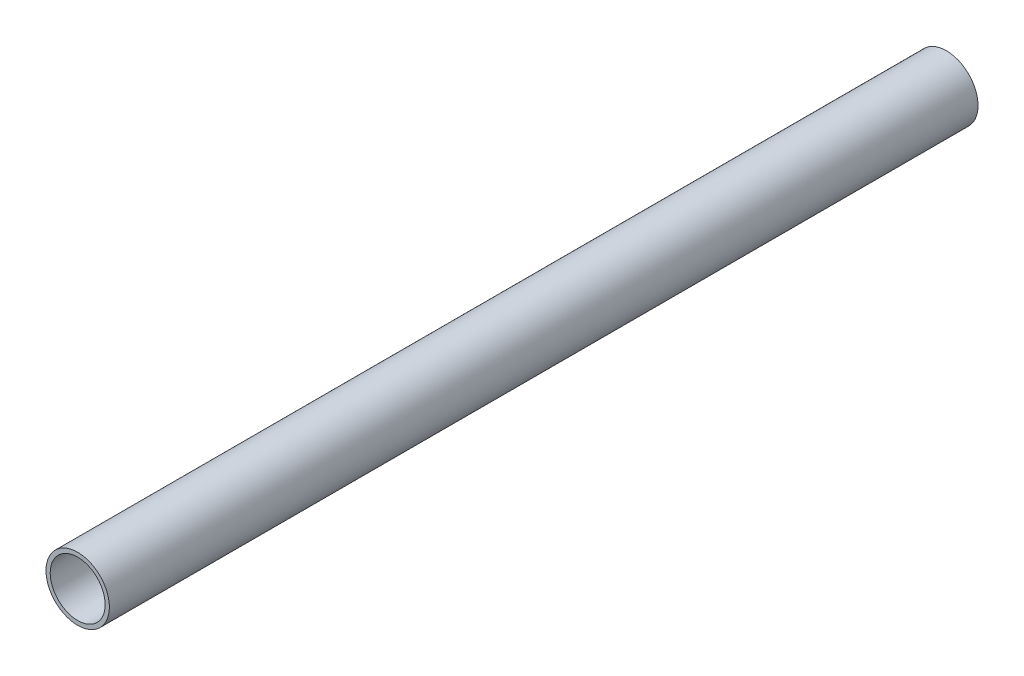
ISO-10303-21;
HEADER;
FILE_DESCRIPTION(('STEP AP214'),'2;1');
FILE_NAME('part.step','',(''),(''),'','','');
FILE_SCHEMA(('AUTOMOTIVE_DESIGN { 1 0 10303 214 1 1 1 1 }'));
ENDSEC;
DATA;
#1=APPLICATION_CONTEXT('core data for automotive mechanical design processes');
#2=APPLICATION_PROTOCOL_DEFINITION('international standard','automotive_design',2000,#1);
#3=PRODUCT_CONTEXT('',#1,'mechanical');
#4=PRODUCT('Part','Part','',(#3));
#5=PRODUCT_RELATED_PRODUCT_CATEGORY('part','',(#4));
#6=PRODUCT_DEFINITION_FORMATION('','',#4);
#7=PRODUCT_DEFINITION_CONTEXT('part definition',#1,'design');
#8=PRODUCT_DEFINITION('design','',#6,#7);
#9=PRODUCT_DEFINITION_SHAPE('','',#8);
#10=(LENGTH_UNIT() NAMED_UNIT(*) SI_UNIT(.MILLI.,.METRE.));
#11=(NAMED_UNIT(*) PLANE_ANGLE_UNIT() SI_UNIT($,.RADIAN.));
#12=(NAMED_UNIT(*) SI_UNIT($,.STERADIAN.) SOLID_ANGLE_UNIT());
#13=UNCERTAINTY_MEASURE_WITH_UNIT(LENGTH_MEASURE(1.E-05),#10,'distance_accuracy_value','');
#14=(GEOMETRIC_REPRESENTATION_CONTEXT(3) GLOBAL_UNCERTAINTY_ASSIGNED_CONTEXT((#13)) GLOBAL_UNIT_ASSIGNED_CONTEXT((#10,
#11,#12)) REPRESENTATION_CONTEXT('',''));
#15=CARTESIAN_POINT('',(0.,0.,0.));
#16=DIRECTION('',(0.,0.,1.));
#17=DIRECTION('',(1.,0.,0.));
#18=AXIS2_PLACEMENT_3D('',#15,#16,#17);
#19=CARTESIAN_POINT('',(0.,0.,304.8));
#20=DIRECTION('',(0.,0.,1.));
#21=DIRECTION('',(1.,0.,0.));
#22=AXIS2_PLACEMENT_3D('',#19,#20,#21);
#23=PLANE('',#22);
#24=CARTESIAN_POINT('',(0.,0.,304.8));
#25=DIRECTION('',(0.,0.,1.));
#26=DIRECTION('',(1.,0.,0.));
#27=AXIS2_PLACEMENT_3D('',#24,#25,#26);
#28=CIRCLE('',#27,11.1125);
#29=CARTESIAN_POINT('',(-11.1125,0.,304.8));
#30=VERTEX_POINT('',#29);
#31=EDGE_CURVE('E11',#30,#30,#28,.T.);
#32=ORIENTED_EDGE('',*,*,#31,.T.);
#33=EDGE_LOOP('',(#32));
#34=FACE_BOUND('',#33,.T.);
#35=CARTESIAN_POINT('',(0.,0.,304.8));
#36=DIRECTION('',(0.,0.,1.));
#37=DIRECTION('',(1.,0.,0.));
#38=AXIS2_PLACEMENT_3D('',#35,#36,#37);
#39=CIRCLE('',#38,9.6393);
#40=CARTESIAN_POINT('',(-9.6393,0.,304.8));
#41=VERTEX_POINT('',#40);
#42=EDGE_CURVE('E48',#41,#41,#39,.T.);
#43=ORIENTED_EDGE('',*,*,#42,.F.);
#44=EDGE_LOOP('',(#43));
#45=FACE_BOUND('',#44,.T.);
#46=ADVANCED_FACE('F37',(#34,#45),#23,.T.);
#47=CARTESIAN_POINT('',(0.,0.,0.));
#48=DIRECTION('',(0.,0.,1.));
#49=DIRECTION('',(1.,0.,0.));
#50=AXIS2_PLACEMENT_3D('',#47,#48,#49);
#51=PLANE('',#50);
#52=CARTESIAN_POINT('',(0.,0.,0.));
#53=DIRECTION('',(0.,0.,1.));
#54=DIRECTION('',(1.,0.,0.));
#55=AXIS2_PLACEMENT_3D('',#52,#53,#54);
#56=CIRCLE('',#55,11.1125);
#57=CARTESIAN_POINT('',(-11.1125,0.,0.));
#58=VERTEX_POINT('',#57);
#59=EDGE_CURVE('E41',#58,#58,#56,.T.);
#60=ORIENTED_EDGE('',*,*,#59,.F.);
#61=EDGE_LOOP('',(#60));
#62=FACE_BOUND('',#61,.T.);
#63=CARTESIAN_POINT('',(0.,0.,0.));
#64=DIRECTION('',(0.,0.,1.));
#65=DIRECTION('',(1.,0.,0.));
#66=AXIS2_PLACEMENT_3D('',#63,#64,#65);
#67=CIRCLE('',#66,9.6393);
#68=CARTESIAN_POINT('',(-9.6393,0.,0.));
#69=VERTEX_POINT('',#68);
#70=EDGE_CURVE('E50',#69,#69,#67,.T.);
#71=ORIENTED_EDGE('',*,*,#70,.T.);
#72=EDGE_LOOP('',(#71));
#73=FACE_BOUND('',#72,.T.);
#74=ADVANCED_FACE('F60',(#62,#73),#51,.F.);
#75=CARTESIAN_POINT('',(0.,0.,304.8));
#76=DIRECTION('',(0.,0.,-1.));
#77=DIRECTION('',(-1.,0.,0.));
#78=AXIS2_PLACEMENT_3D('',#75,#76,#77);
#79=CYLINDRICAL_SURFACE('',#78,11.1125);
#80=CARTESIAN_POINT('',(-11.1125,0.,304.8));
#81=CARTESIAN_POINT('',(-11.1125,0.,301.625));
#82=CARTESIAN_POINT('',(-11.1125,0.,298.45));
#83=CARTESIAN_POINT('',(-11.1125,0.,292.1));
#84=CARTESIAN_POINT('',(-11.1125,0.,288.925));
#85=CARTESIAN_POINT('',(-11.1125,0.,282.575));
#86=CARTESIAN_POINT('',(-11.1125,0.,279.4));
#87=CARTESIAN_POINT('',(-11.1125,0.,273.05));
#88=CARTESIAN_POINT('',(-11.1125,0.,269.875));
#89=CARTESIAN_POINT('',(-11.1125,0.,263.525));
#90=CARTESIAN_POINT('',(-11.1125,0.,260.35));
#91=CARTESIAN_POINT('',(-11.1125,0.,254.));
#92=CARTESIAN_POINT('',(-11.1125,0.,250.825));
#93=CARTESIAN_POINT('',(-11.1125,0.,244.475));
#94=CARTESIAN_POINT('',(-11.1125,0.,241.3));
#95=CARTESIAN_POINT('',(-11.1125,0.,234.95));
#96=CARTESIAN_POINT('',(-11.1125,0.,231.775));
#97=CARTESIAN_POINT('',(-11.1125,0.,225.425));
#98=CARTESIAN_POINT('',(-11.1125,0.,222.25));
#99=CARTESIAN_POINT('',(-11.1125,0.,215.9));
#100=CARTESIAN_POINT('',(-11.1125,0.,212.725));
#101=CARTESIAN_POINT('',(-11.1125,0.,206.375));
#102=CARTESIAN_POINT('',(-11.1125,0.,203.2));
#103=CARTESIAN_POINT('',(-11.1125,0.,196.85));
#104=CARTESIAN_POINT('',(-11.1125,0.,193.675));
#105=CARTESIAN_POINT('',(-11.1125,0.,187.325));
#106=CARTESIAN_POINT('',(-11.1125,0.,184.15));
#107=CARTESIAN_POINT('',(-11.1125,0.,177.8));
#108=CARTESIAN_POINT('',(-11.1125,0.,174.625));
#109=CARTESIAN_POINT('',(-11.1125,0.,168.275));
#110=CARTESIAN_POINT('',(-11.1125,0.,165.1));
#111=CARTESIAN_POINT('',(-11.1125,0.,158.75));
#112=CARTESIAN_POINT('',(-11.1125,0.,155.575));
#113=CARTESIAN_POINT('',(-11.1125,0.,149.225));
#114=CARTESIAN_POINT('',(-11.1125,0.,146.05));
#115=CARTESIAN_POINT('',(-11.1125,0.,139.7));
#116=CARTESIAN_POINT('',(-11.1125,0.,136.525));
#117=CARTESIAN_POINT('',(-11.1125,0.,130.175));
#118=CARTESIAN_POINT('',(-11.1125,0.,127.));
#119=CARTESIAN_POINT('',(-11.1125,0.,120.65));
#120=CARTESIAN_POINT('',(-11.1125,0.,117.475));
#121=CARTESIAN_POINT('',(-11.1125,0.,111.125));
#122=CARTESIAN_POINT('',(-11.1125,0.,107.95));
#123=CARTESIAN_POINT('',(-11.1125,0.,101.6));
#124=CARTESIAN_POINT('',(-11.1125,0.,98.425));
#125=CARTESIAN_POINT('',(-11.1125,0.,92.075));
#126=CARTESIAN_POINT('',(-11.1125,0.,88.9));
#127=CARTESIAN_POINT('',(-11.1125,0.,82.55));
#128=CARTESIAN_POINT('',(-11.1125,0.,79.375));
#129=CARTESIAN_POINT('',(-11.1125,0.,73.025));
#130=CARTESIAN_POINT('',(-11.1125,0.,69.85));
#131=CARTESIAN_POINT('',(-11.1125,0.,63.5));
#132=CARTESIAN_POINT('',(-11.1125,0.,60.325));
#133=CARTESIAN_POINT('',(-11.1125,0.,53.975));
#134=CARTESIAN_POINT('',(-11.1125,0.,50.8));
#135=CARTESIAN_POINT('',(-11.1125,0.,44.45));
#136=CARTESIAN_POINT('',(-11.1125,0.,41.275));
#137=CARTESIAN_POINT('',(-11.1125,0.,34.925));
#138=CARTESIAN_POINT('',(-11.1125,0.,31.75));
#139=CARTESIAN_POINT('',(-11.1125,0.,25.4));
#140=CARTESIAN_POINT('',(-11.1125,0.,22.225));
#141=CARTESIAN_POINT('',(-11.1125,0.,15.875));
#142=CARTESIAN_POINT('',(-11.1125,0.,12.7));
#143=CARTESIAN_POINT('',(-11.1125,0.,6.35));
#144=CARTESIAN_POINT('',(-11.1125,0.,3.175));
#145=CARTESIAN_POINT('',(-11.1125,0.,0.));
#146=B_SPLINE_CURVE_WITH_KNOTS('',3,(#80,#81,#82,#83,#84,#85,#86,#87,#88,#89,#90,#91,#92,#93,
#94,#95,#96,#97,#98,#99,#100,#101,#102,#103,#104,#105,#106,#107,#108,#109,#110,#111,#112,#113,
#114,#115,#116,#117,#118,#119,#120,#121,#122,#123,#124,#125,#126,#127,#128,#129,#130,#131,#132,
#133,#134,#135,#136,#137,#138,#139,#140,#141,#142,#143,#144,#145),.UNSPECIFIED.,.F.,.F.,(4,2,2,
2,2,2,2,2,2,2,2,2,2,2,2,2,2,2,2,2,2,2,2,2,2,2,2,2,2,2,2,2,4),(0.,9.52499999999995,19.05,28.575,
38.1,47.625,57.15,66.675,76.2,85.725,95.2499999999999,104.775,114.3,123.825,133.35,142.875,
152.4,161.925,171.45,180.975,190.5,200.025,209.55,219.075,228.6,238.125,247.65,257.175,266.7,
276.225,285.75,295.275,304.8),.UNSPECIFIED.);
#147=EDGE_CURVE('BSEAM39',#30,#58,#146,.T.);
#148=ORIENTED_EDGE('',*,*,#31,.F.);
#149=ORIENTED_EDGE('',*,*,#59,.T.);
#150=ORIENTED_EDGE('',*,*,#147,.T.);
#151=ORIENTED_EDGE('',*,*,#147,.F.);
#152=EDGE_LOOP('',(#148,#150,#149,#151));
#153=FACE_BOUND('',#152,.T.);
#154=ADVANCED_FACE('F39',(#153),#79,.T.);
#155=CARTESIAN_POINT('',(0.,0.,304.8));
#156=DIRECTION('',(0.,0.,-1.));
#157=DIRECTION('',(-1.,0.,0.));
#158=AXIS2_PLACEMENT_3D('',#155,#156,#157);
#159=CYLINDRICAL_SURFACE('',#158,9.6393);
#160=CARTESIAN_POINT('',(-9.6393,0.,304.8));
#161=CARTESIAN_POINT('',(-9.6393,0.,301.625));
#162=CARTESIAN_POINT('',(-9.6393,0.,298.45));
#163=CARTESIAN_POINT('',(-9.6393,0.,292.1));
#164=CARTESIAN_POINT('',(-9.6393,0.,288.925));
#165=CARTESIAN_POINT('',(-9.6393,0.,282.575));
#166=CARTESIAN_POINT('',(-9.6393,0.,279.4));
#167=CARTESIAN_POINT('',(-9.6393,0.,273.05));
#168=CARTESIAN_POINT('',(-9.6393,0.,269.875));
#169=CARTESIAN_POINT('',(-9.6393,0.,263.525));
#170=CARTESIAN_POINT('',(-9.6393,0.,260.35));
#171=CARTESIAN_POINT('',(-9.6393,0.,254.));
#172=CARTESIAN_POINT('',(-9.6393,0.,250.825));
#173=CARTESIAN_POINT('',(-9.6393,0.,244.475));
#174=CARTESIAN_POINT('',(-9.6393,0.,241.3));
#175=CARTESIAN_POINT('',(-9.6393,0.,234.95));
#176=CARTESIAN_POINT('',(-9.6393,0.,231.775));
#177=CARTESIAN_POINT('',(-9.6393,0.,225.425));
#178=CARTESIAN_POINT('',(-9.6393,0.,222.25));
#179=CARTESIAN_POINT('',(-9.6393,0.,215.9));
#180=CARTESIAN_POINT('',(-9.6393,0.,212.725));
#181=CARTESIAN_POINT('',(-9.6393,0.,206.375));
#182=CARTESIAN_POINT('',(-9.6393,0.,203.2));
#183=CARTESIAN_POINT('',(-9.6393,0.,196.85));
#184=CARTESIAN_POINT('',(-9.6393,0.,193.675));
#185=CARTESIAN_POINT('',(-9.6393,0.,187.325));
#186=CARTESIAN_POINT('',(-9.6393,0.,184.15));
#187=CARTESIAN_POINT('',(-9.6393,0.,177.8));
#188=CARTESIAN_POINT('',(-9.6393,0.,174.625));
#189=CARTESIAN_POINT('',(-9.6393,0.,168.275));
#190=CARTESIAN_POINT('',(-9.6393,0.,165.1));
#191=CARTESIAN_POINT('',(-9.6393,0.,158.75));
#192=CARTESIAN_POINT('',(-9.6393,0.,155.575));
#193=CARTESIAN_POINT('',(-9.6393,0.,149.225));
#194=CARTESIAN_POINT('',(-9.6393,0.,146.05));
#195=CARTESIAN_POINT('',(-9.6393,0.,139.7));
#196=CARTESIAN_POINT('',(-9.6393,0.,136.525));
#197=CARTESIAN_POINT('',(-9.6393,0.,130.175));
#198=CARTESIAN_POINT('',(-9.6393,0.,127.));
#199=CARTESIAN_POINT('',(-9.6393,0.,120.65));
#200=CARTESIAN_POINT('',(-9.6393,0.,117.475));
#201=CARTESIAN_POINT('',(-9.6393,0.,111.125));
#202=CARTESIAN_POINT('',(-9.6393,0.,107.95));
#203=CARTESIAN_POINT('',(-9.6393,0.,101.6));
#204=CARTESIAN_POINT('',(-9.6393,0.,98.425));
#205=CARTESIAN_POINT('',(-9.6393,0.,92.075));
#206=CARTESIAN_POINT('',(-9.6393,0.,88.9));
#207=CARTESIAN_POINT('',(-9.6393,0.,82.55));
#208=CARTESIAN_POINT('',(-9.6393,0.,79.375));
#209=CARTESIAN_POINT('',(-9.6393,0.,73.025));
#210=CARTESIAN_POINT('',(-9.6393,0.,69.85));
#211=CARTESIAN_POINT('',(-9.6393,0.,63.5));
#212=CARTESIAN_POINT('',(-9.6393,0.,60.325));
#213=CARTESIAN_POINT('',(-9.6393,0.,53.975));
#214=CARTESIAN_POINT('',(-9.6393,0.,50.8));
#215=CARTESIAN_POINT('',(-9.6393,0.,44.45));
#216=CARTESIAN_POINT('',(-9.6393,0.,41.275));
#217=CARTESIAN_POINT('',(-9.6393,0.,34.925));
#218=CARTESIAN_POINT('',(-9.6393,0.,31.75));
#219=CARTESIAN_POINT('',(-9.6393,0.,25.4));
#220=CARTESIAN_POINT('',(-9.6393,0.,22.225));
#221=CARTESIAN_POINT('',(-9.6393,0.,15.875));
#222=CARTESIAN_POINT('',(-9.6393,0.,12.7));
#223=CARTESIAN_POINT('',(-9.6393,0.,6.35));
#224=CARTESIAN_POINT('',(-9.6393,0.,3.175));
#225=CARTESIAN_POINT('',(-9.6393,0.,0.));
#226=B_SPLINE_CURVE_WITH_KNOTS('',3,(#160,#161,#162,#163,#164,#165,#166,#167,#168,#169,#170,
#171,#172,#173,#174,#175,#176,#177,#178,#179,#180,#181,#182,#183,#184,#185,#186,#187,#188,#189,
#190,#191,#192,#193,#194,#195,#196,#197,#198,#199,#200,#201,#202,#203,#204,#205,#206,#207,#208,
#209,#210,#211,#212,#213,#214,#215,#216,#217,#218,#219,#220,#221,#222,#223,#224,#225),
.UNSPECIFIED.,.F.,.F.,(4,2,2,2,2,2,2,2,2,2,2,2,2,2,2,2,2,2,2,2,2,2,2,2,2,2,2,2,2,2,2,2,4),(0.,
9.52499999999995,19.05,28.575,38.1,47.625,57.15,66.675,76.2,85.725,95.2499999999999,104.775,
114.3,123.825,133.35,142.875,152.4,161.925,171.45,180.975,190.5,200.025,209.55,219.075,228.6,
238.125,247.65,257.175,266.7,276.225,285.75,295.275,304.8),.UNSPECIFIED.);
#227=EDGE_CURVE('BSEAM56',#41,#69,#226,.T.);
#228=ORIENTED_EDGE('',*,*,#42,.T.);
#229=ORIENTED_EDGE('',*,*,#70,.F.);
#230=ORIENTED_EDGE('',*,*,#227,.T.);
#231=ORIENTED_EDGE('',*,*,#227,.F.);
#232=EDGE_LOOP('',(#228,#230,#229,#231));
#233=FACE_BOUND('',#232,.T.);
#234=ADVANCED_FACE('F56',(#233),#159,.F.);
#235=CLOSED_SHELL('',(#46,#74,#154,#234));
#236=MANIFOLD_SOLID_BREP('B2',#235);
#237=ADVANCED_BREP_SHAPE_REPRESENTATION('',(#18,#236),#14);
#238=SHAPE_DEFINITION_REPRESENTATION(#9,#237);
ENDSEC;
END-ISO-10303-21;
